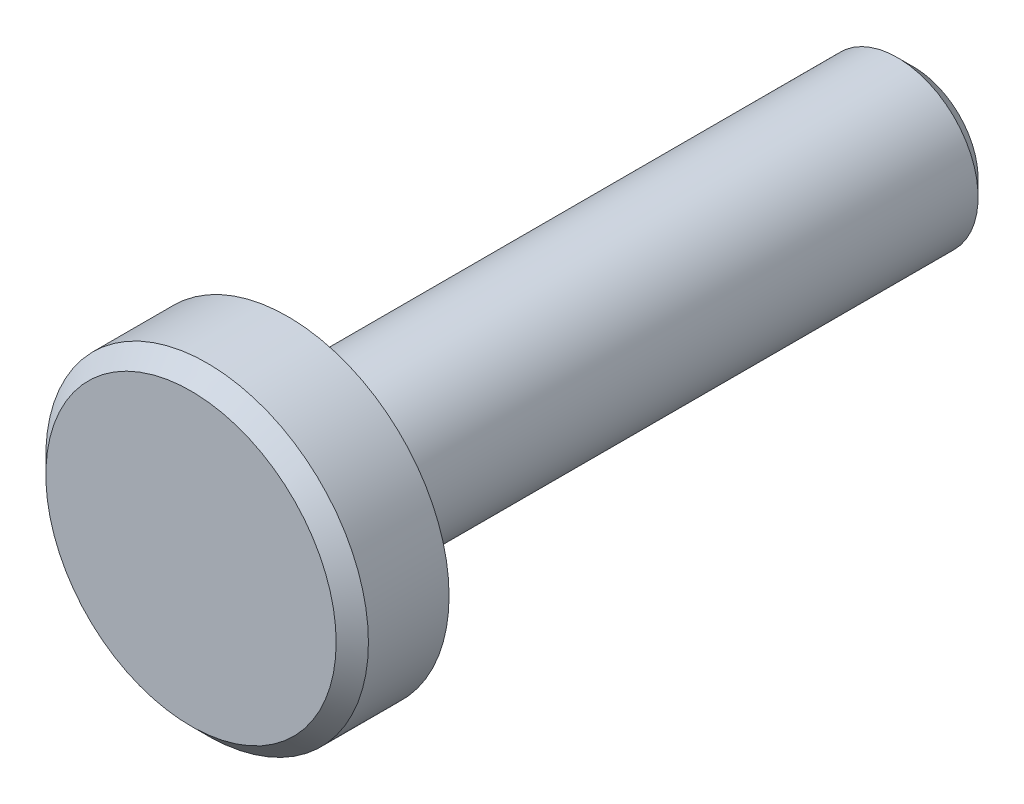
ISO-10303-21;
HEADER;
FILE_DESCRIPTION(('STEP AP214'),'2;1');
FILE_NAME('part.step','',(''),(''),'','','');
FILE_SCHEMA(('AUTOMOTIVE_DESIGN { 1 0 10303 214 1 1 1 1 }'));
ENDSEC;
DATA;
#1=APPLICATION_CONTEXT('core data for automotive mechanical design processes');
#2=APPLICATION_PROTOCOL_DEFINITION('international standard','automotive_design',2000,#1);
#3=PRODUCT_CONTEXT('',#1,'mechanical');
#4=PRODUCT('Part','Part','',(#3));
#5=PRODUCT_RELATED_PRODUCT_CATEGORY('part','',(#4));
#6=PRODUCT_DEFINITION_FORMATION('','',#4);
#7=PRODUCT_DEFINITION_CONTEXT('part definition',#1,'design');
#8=PRODUCT_DEFINITION('design','',#6,#7);
#9=PRODUCT_DEFINITION_SHAPE('','',#8);
#10=(LENGTH_UNIT() NAMED_UNIT(*) SI_UNIT(.MILLI.,.METRE.));
#11=(NAMED_UNIT(*) PLANE_ANGLE_UNIT() SI_UNIT($,.RADIAN.));
#12=(NAMED_UNIT(*) SI_UNIT($,.STERADIAN.) SOLID_ANGLE_UNIT());
#13=UNCERTAINTY_MEASURE_WITH_UNIT(LENGTH_MEASURE(1.E-05),#10,'distance_accuracy_value','');
#14=(GEOMETRIC_REPRESENTATION_CONTEXT(3) GLOBAL_UNCERTAINTY_ASSIGNED_CONTEXT((#13)) GLOBAL_UNIT_ASSIGNED_CONTEXT((#10,
#11,#12)) REPRESENTATION_CONTEXT('',''));
#15=CARTESIAN_POINT('',(0.,0.,0.));
#16=DIRECTION('',(0.,0.,1.));
#17=DIRECTION('',(1.,0.,0.));
#18=AXIS2_PLACEMENT_3D('',#15,#16,#17);
#19=CARTESIAN_POINT('',(-14.0110338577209,-19.5,5.7));
#20=DIRECTION('',(0.,0.,-1.));
#21=DIRECTION('',(-1.,0.,0.));
#22=AXIS2_PLACEMENT_3D('',#19,#20,#21);
#23=CYLINDRICAL_SURFACE('',#22,1.25);
#24=CARTESIAN_POINT('',(-14.0110338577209,-19.5,-3.74999999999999));
#25=DIRECTION('',(0.,0.,-1.));
#26=DIRECTION('',(-1.,0.,0.));
#27=AXIS2_PLACEMENT_3D('',#24,#25,#26);
#28=CIRCLE('',#27,1.25);
#29=CARTESIAN_POINT('',(-15.2610338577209,-19.5,-3.74999999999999));
#30=VERTEX_POINT('',#29);
#31=EDGE_CURVE('E42',#30,#30,#28,.F.);
#32=ORIENTED_EDGE('',*,*,#31,.T.);
#33=EDGE_LOOP('',(#32));
#34=FACE_BOUND('',#33,.T.);
#35=CARTESIAN_POINT('',(-14.0110338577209,-19.5,5.7));
#36=DIRECTION('',(0.,0.,1.));
#37=DIRECTION('',(1.,0.,0.));
#38=AXIS2_PLACEMENT_3D('',#35,#36,#37);
#39=CIRCLE('',#38,1.25);
#40=CARTESIAN_POINT('',(-12.7610338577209,-19.5,5.7));
#41=VERTEX_POINT('',#40);
#42=EDGE_CURVE('E47',#41,#41,#39,.T.);
#43=ORIENTED_EDGE('',*,*,#42,.F.);
#44=EDGE_LOOP('',(#43));
#45=FACE_BOUND('',#44,.T.);
#46=ADVANCED_FACE('F28',(#34,#45),#23,.T.);
#47=CARTESIAN_POINT('',(-14.0110338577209,-19.5,-4.));
#48=DIRECTION('',(0.,0.,-1.));
#49=DIRECTION('',(-1.,0.,0.));
#50=AXIS2_PLACEMENT_3D('',#47,#48,#49);
#51=PLANE('',#50);
#52=CARTESIAN_POINT('',(-14.0110338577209,-19.5,-4.));
#53=DIRECTION('',(0.,0.,-1.));
#54=DIRECTION('',(-1.,0.,0.));
#55=AXIS2_PLACEMENT_3D('',#52,#53,#54);
#56=CIRCLE('',#55,0.999999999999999);
#57=CARTESIAN_POINT('',(-15.0110338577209,-19.5,-4.));
#58=VERTEX_POINT('',#57);
#59=EDGE_CURVE('E38',#58,#58,#56,.T.);
#60=ORIENTED_EDGE('',*,*,#59,.T.);
#61=EDGE_LOOP('',(#60));
#62=FACE_BOUND('',#61,.T.);
#63=ADVANCED_FACE('F59',(#62),#51,.T.);
#64=CARTESIAN_POINT('',(-14.0110338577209,-19.5,5.7));
#65=DIRECTION('',(0.,0.,1.));
#66=DIRECTION('',(1.,0.,0.));
#67=AXIS2_PLACEMENT_3D('',#64,#65,#66);
#68=PLANE('',#67);
#69=CARTESIAN_POINT('',(-14.0110338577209,-19.5,5.7));
#70=DIRECTION('',(0.,0.,1.));
#71=DIRECTION('',(1.,0.,0.));
#72=AXIS2_PLACEMENT_3D('',#69,#70,#71);
#73=CIRCLE('',#72,2.5);
#74=CARTESIAN_POINT('',(-11.5110338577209,-19.5,5.7));
#75=VERTEX_POINT('',#74);
#76=EDGE_CURVE('E50',#75,#75,#73,.T.);
#77=ORIENTED_EDGE('',*,*,#76,.F.);
#78=EDGE_LOOP('',(#77));
#79=FACE_BOUND('',#78,.T.);
#80=ORIENTED_EDGE('',*,*,#42,.T.);
#81=EDGE_LOOP('',(#80));
#82=FACE_BOUND('',#81,.T.);
#83=ADVANCED_FACE('F56',(#79,#82),#68,.F.);
#84=CARTESIAN_POINT('',(-14.0110338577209,-19.5,7.2));
#85=DIRECTION('',(0.,0.,-1.));
#86=DIRECTION('',(-1.,0.,0.));
#87=AXIS2_PLACEMENT_3D('',#84,#85,#86);
#88=CYLINDRICAL_SURFACE('',#87,2.5);
#89=CARTESIAN_POINT('',(-14.0110338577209,-19.5,6.95));
#90=DIRECTION('',(0.,0.,1.));
#91=DIRECTION('',(1.,0.,0.));
#92=AXIS2_PLACEMENT_3D('',#89,#90,#91);
#93=CIRCLE('',#92,2.5);
#94=CARTESIAN_POINT('',(-11.5110338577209,-19.5,6.95));
#95=VERTEX_POINT('',#94);
#96=EDGE_CURVE('E10',#95,#95,#93,.F.);
#97=ORIENTED_EDGE('',*,*,#96,.T.);
#98=EDGE_LOOP('',(#97));
#99=FACE_BOUND('',#98,.T.);
#100=ORIENTED_EDGE('',*,*,#76,.T.);
#101=EDGE_LOOP('',(#100));
#102=FACE_BOUND('',#101,.T.);
#103=ADVANCED_FACE('F54',(#99,#102),#88,.T.);
#104=CARTESIAN_POINT('',(-14.0110338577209,-19.5,7.2));
#105=DIRECTION('',(0.,0.,1.));
#106=DIRECTION('',(1.,0.,0.));
#107=AXIS2_PLACEMENT_3D('',#104,#105,#106);
#108=PLANE('',#107);
#109=CARTESIAN_POINT('',(-14.0110338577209,-19.5,7.2));
#110=DIRECTION('',(0.,0.,1.));
#111=DIRECTION('',(1.,0.,0.));
#112=AXIS2_PLACEMENT_3D('',#109,#110,#111);
#113=CIRCLE('',#112,2.25);
#114=CARTESIAN_POINT('',(-11.7610338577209,-19.5,7.2));
#115=VERTEX_POINT('',#114);
#116=EDGE_CURVE('E34',#115,#115,#113,.T.);
#117=ORIENTED_EDGE('',*,*,#116,.T.);
#118=EDGE_LOOP('',(#117));
#119=FACE_BOUND('',#118,.T.);
#120=ADVANCED_FACE('F74',(#119),#108,.T.);
#121=CARTESIAN_POINT('',(-14.0110338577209,-19.5,-3.74999999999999));
#122=DIRECTION('',(0.,0.,1.));
#123=DIRECTION('',(1.,0.,0.));
#124=AXIS2_PLACEMENT_3D('',#121,#122,#123);
#125=CONICAL_SURFACE('',#124,1.25,0.785398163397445);
#126=ORIENTED_EDGE('',*,*,#59,.F.);
#127=EDGE_LOOP('',(#126));
#128=FACE_BOUND('',#127,.T.);
#129=ORIENTED_EDGE('',*,*,#31,.F.);
#130=EDGE_LOOP('',(#129));
#131=FACE_BOUND('',#130,.T.);
#132=ADVANCED_FACE('F71',(#128,#131),#125,.T.);
#133=CARTESIAN_POINT('',(-14.0110338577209,-19.5,7.2));
#134=DIRECTION('',(0.,0.,-1.));
#135=DIRECTION('',(-1.,0.,0.));
#136=AXIS2_PLACEMENT_3D('',#133,#134,#135);
#137=CONICAL_SURFACE('',#136,2.25,0.785398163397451);
#138=ORIENTED_EDGE('',*,*,#96,.F.);
#139=EDGE_LOOP('',(#138));
#140=FACE_BOUND('',#139,.T.);
#141=ORIENTED_EDGE('',*,*,#116,.F.);
#142=EDGE_LOOP('',(#141));
#143=FACE_BOUND('',#142,.T.);
#144=ADVANCED_FACE('F73',(#140,#143),#137,.T.);
#145=CLOSED_SHELL('',(#46,#63,#83,#103,#120,#132,#144));
#146=MANIFOLD_SOLID_BREP('B2',#145);
#147=ADVANCED_BREP_SHAPE_REPRESENTATION('',(#18,#146),#14);
#148=SHAPE_DEFINITION_REPRESENTATION(#9,#147);
ENDSEC;
END-ISO-10303-21;
